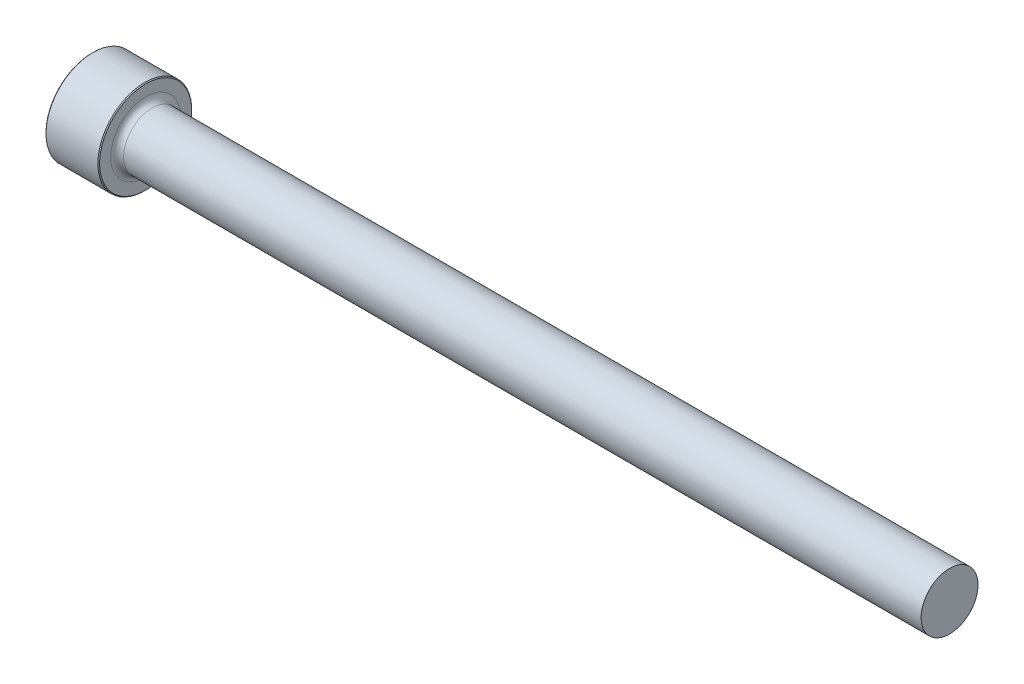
ISO-10303-21;
HEADER;
FILE_DESCRIPTION(('STEP AP214'),'2;1');
FILE_NAME('part.step','',(''),(''),'','','');
FILE_SCHEMA(('AUTOMOTIVE_DESIGN { 1 0 10303 214 1 1 1 1 }'));
ENDSEC;
DATA;
#1=APPLICATION_CONTEXT('core data for automotive mechanical design processes');
#2=APPLICATION_PROTOCOL_DEFINITION('international standard','automotive_design',2000,#1);
#3=PRODUCT_CONTEXT('',#1,'mechanical');
#4=PRODUCT('Part','Part','',(#3));
#5=PRODUCT_RELATED_PRODUCT_CATEGORY('part','',(#4));
#6=PRODUCT_DEFINITION_FORMATION('','',#4);
#7=PRODUCT_DEFINITION_CONTEXT('part definition',#1,'design');
#8=PRODUCT_DEFINITION('design','',#6,#7);
#9=PRODUCT_DEFINITION_SHAPE('','',#8);
#10=(LENGTH_UNIT() NAMED_UNIT(*) SI_UNIT(.MILLI.,.METRE.));
#11=(NAMED_UNIT(*) PLANE_ANGLE_UNIT() SI_UNIT($,.RADIAN.));
#12=(NAMED_UNIT(*) SI_UNIT($,.STERADIAN.) SOLID_ANGLE_UNIT());
#13=UNCERTAINTY_MEASURE_WITH_UNIT(LENGTH_MEASURE(1.E-05),#10,'distance_accuracy_value','');
#14=(GEOMETRIC_REPRESENTATION_CONTEXT(3) GLOBAL_UNCERTAINTY_ASSIGNED_CONTEXT((#13)) GLOBAL_UNIT_ASSIGNED_CONTEXT((#10,
#11,#12)) REPRESENTATION_CONTEXT('',''));
#15=CARTESIAN_POINT('',(0.,0.,0.));
#16=DIRECTION('',(0.,0.,1.));
#17=DIRECTION('',(1.,0.,0.));
#18=AXIS2_PLACEMENT_3D('',#15,#16,#17);
#19=CARTESIAN_POINT('',(101.6,3.36962749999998,0.));
#20=DIRECTION('',(1.,0.,0.));
#21=DIRECTION('',(0.,1.,0.));
#22=AXIS2_PLACEMENT_3D('',#19,#20,#21);
#23=PLANE('',#22);
#24=CARTESIAN_POINT('',(101.6,0.,0.));
#25=DIRECTION('',(1.,0.,0.));
#26=DIRECTION('',(0.,1.,0.));
#27=AXIS2_PLACEMENT_3D('',#24,#25,#26);
#28=CIRCLE('',#27,3.36962749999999);
#29=CARTESIAN_POINT('',(101.6,3.36962749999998,0.));
#30=VERTEX_POINT('',#29);
#31=EDGE_CURVE('E51',#30,#30,#28,.T.);
#32=ORIENTED_EDGE('',*,*,#31,.T.);
#33=EDGE_LOOP('',(#32));
#34=FACE_BOUND('',#33,.T.);
#35=ADVANCED_FACE('F31',(#34),#23,.T.);
#36=CARTESIAN_POINT('',(101.6,0.,0.));
#37=DIRECTION('',(1.,0.,0.));
#38=DIRECTION('',(0.,1.,0.));
#39=AXIS2_PLACEMENT_3D('',#36,#37,#38);
#40=CYLINDRICAL_SURFACE('',#39,3.36962749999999);
#41=CARTESIAN_POINT('',(7.11199999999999,0.,0.));
#42=DIRECTION('',(1.,0.,0.));
#43=DIRECTION('',(0.,1.,0.));
#44=AXIS2_PLACEMENT_3D('',#41,#42,#43);
#45=CIRCLE('',#44,3.3696275);
#46=CARTESIAN_POINT('',(7.11199999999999,3.36962749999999,0.));
#47=VERTEX_POINT('',#46);
#48=EDGE_CURVE('E54',#47,#47,#45,.T.);
#49=ORIENTED_EDGE('',*,*,#48,.T.);
#50=EDGE_LOOP('',(#49));
#51=FACE_BOUND('',#50,.T.);
#52=ORIENTED_EDGE('',*,*,#31,.F.);
#53=EDGE_LOOP('',(#52));
#54=FACE_BOUND('',#53,.T.);
#55=ADVANCED_FACE('F75',(#51,#54),#40,.T.);
#56=CARTESIAN_POINT('',(7.112,0.,0.));
#57=DIRECTION('',(1.,0.,0.));
#58=DIRECTION('',(0.,1.,0.));
#59=AXIS2_PLACEMENT_3D('',#56,#57,#58);
#60=TOROIDAL_SURFACE('',#59,4.13162749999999,0.762);
#61=CARTESIAN_POINT('',(6.34999999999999,0.,0.));
#62=DIRECTION('',(1.,0.,0.));
#63=DIRECTION('',(0.,1.,0.));
#64=AXIS2_PLACEMENT_3D('',#61,#62,#63);
#65=CIRCLE('',#64,4.13162749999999);
#66=CARTESIAN_POINT('',(6.34999999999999,4.13162749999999,0.));
#67=VERTEX_POINT('',#66);
#68=EDGE_CURVE('E57',#67,#67,#65,.T.);
#69=ORIENTED_EDGE('',*,*,#68,.T.);
#70=EDGE_LOOP('',(#69));
#71=FACE_BOUND('',#70,.T.);
#72=ORIENTED_EDGE('',*,*,#48,.F.);
#73=EDGE_LOOP('',(#72));
#74=FACE_BOUND('',#73,.T.);
#75=ADVANCED_FACE('F61',(#71,#74),#60,.F.);
#76=CARTESIAN_POINT('',(6.35,5.55625,0.));
#77=DIRECTION('',(1.,0.,0.));
#78=DIRECTION('',(0.,1.,0.));
#79=AXIS2_PLACEMENT_3D('',#76,#77,#78);
#80=PLANE('',#79);
#81=CARTESIAN_POINT('',(6.35,0.,0.));
#82=DIRECTION('',(1.,0.,0.));
#83=DIRECTION('',(0.,1.,0.));
#84=AXIS2_PLACEMENT_3D('',#81,#82,#83);
#85=CIRCLE('',#84,5.45465000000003);
#86=CARTESIAN_POINT('',(6.35,5.45465000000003,0.));
#87=VERTEX_POINT('',#86);
#88=EDGE_CURVE('E10',#87,#87,#85,.T.);
#89=ORIENTED_EDGE('',*,*,#88,.T.);
#90=EDGE_LOOP('',(#89));
#91=FACE_BOUND('',#90,.T.);
#92=ORIENTED_EDGE('',*,*,#68,.F.);
#93=EDGE_LOOP('',(#92));
#94=FACE_BOUND('',#93,.T.);
#95=ADVANCED_FACE('F64',(#91,#94),#80,.T.);
#96=CARTESIAN_POINT('',(101.6,0.,0.));
#97=DIRECTION('',(1.,0.,0.));
#98=DIRECTION('',(0.,1.,0.));
#99=AXIS2_PLACEMENT_3D('',#96,#97,#98);
#100=CYLINDRICAL_SURFACE('',#99,5.55625);
#101=CARTESIAN_POINT('',(0.101599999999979,0.,0.));
#102=DIRECTION('',(-1.,0.,0.));
#103=DIRECTION('',(0.,-1.,0.));
#104=AXIS2_PLACEMENT_3D('',#101,#102,#103);
#105=CIRCLE('',#104,5.55625);
#106=CARTESIAN_POINT('',(0.101599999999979,-5.55625,0.));
#107=VERTEX_POINT('',#106);
#108=EDGE_CURVE('E42',#107,#107,#105,.F.);
#109=ORIENTED_EDGE('',*,*,#108,.T.);
#110=EDGE_LOOP('',(#109));
#111=FACE_BOUND('',#110,.T.);
#112=CARTESIAN_POINT('',(6.24840000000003,0.,0.));
#113=DIRECTION('',(1.,0.,0.));
#114=DIRECTION('',(0.,1.,0.));
#115=AXIS2_PLACEMENT_3D('',#112,#113,#114);
#116=CIRCLE('',#115,5.55625);
#117=CARTESIAN_POINT('',(6.24840000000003,5.55625,0.));
#118=VERTEX_POINT('',#117);
#119=EDGE_CURVE('E46',#118,#118,#116,.F.);
#120=ORIENTED_EDGE('',*,*,#119,.T.);
#121=EDGE_LOOP('',(#120));
#122=FACE_BOUND('',#121,.T.);
#123=ADVANCED_FACE('F66',(#111,#122),#100,.T.);
#124=CARTESIAN_POINT('',(0.,0.,0.));
#125=DIRECTION('',(-1.,0.,0.));
#126=DIRECTION('',(0.,-1.,0.));
#127=AXIS2_PLACEMENT_3D('',#124,#125,#126);
#128=PLANE('',#127);
#129=CARTESIAN_POINT('',(0.,0.,0.));
#130=DIRECTION('',(-1.,0.,0.));
#131=DIRECTION('',(0.,-1.,0.));
#132=AXIS2_PLACEMENT_3D('',#129,#130,#131);
#133=CIRCLE('',#132,5.45465000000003);
#134=CARTESIAN_POINT('',(0.,-5.45465000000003,0.));
#135=VERTEX_POINT('',#134);
#136=EDGE_CURVE('E38',#135,#135,#133,.T.);
#137=ORIENTED_EDGE('',*,*,#136,.T.);
#138=EDGE_LOOP('',(#137));
#139=FACE_BOUND('',#138,.T.);
#140=ADVANCED_FACE('F72',(#139),#128,.T.);
#141=CARTESIAN_POINT('',(0.101599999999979,0.,0.));
#142=DIRECTION('',(1.,0.,0.));
#143=DIRECTION('',(0.,1.,0.));
#144=AXIS2_PLACEMENT_3D('',#141,#142,#143);
#145=CONICAL_SURFACE('',#144,5.55625,0.785398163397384);
#146=ORIENTED_EDGE('',*,*,#136,.F.);
#147=EDGE_LOOP('',(#146));
#148=FACE_BOUND('',#147,.T.);
#149=ORIENTED_EDGE('',*,*,#108,.F.);
#150=EDGE_LOOP('',(#149));
#151=FACE_BOUND('',#150,.T.);
#152=ADVANCED_FACE('F85',(#148,#151),#145,.T.);
#153=CARTESIAN_POINT('',(6.34999999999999,0.,0.));
#154=DIRECTION('',(-1.,0.,0.));
#155=DIRECTION('',(0.,-1.,0.));
#156=AXIS2_PLACEMENT_3D('',#153,#154,#155);
#157=CONICAL_SURFACE('',#156,5.45465000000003,0.785398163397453);
#158=ORIENTED_EDGE('',*,*,#119,.F.);
#159=EDGE_LOOP('',(#158));
#160=FACE_BOUND('',#159,.T.);
#161=ORIENTED_EDGE('',*,*,#88,.F.);
#162=EDGE_LOOP('',(#161));
#163=FACE_BOUND('',#162,.T.);
#164=ADVANCED_FACE('F33',(#160,#163),#157,.T.);
#165=CLOSED_SHELL('',(#35,#55,#75,#95,#123,#140,#152,#164));
#166=MANIFOLD_SOLID_BREP('B2',#165);
#167=ADVANCED_BREP_SHAPE_REPRESENTATION('',(#18,#166),#14);
#168=SHAPE_DEFINITION_REPRESENTATION(#9,#167);
ENDSEC;
END-ISO-10303-21;
